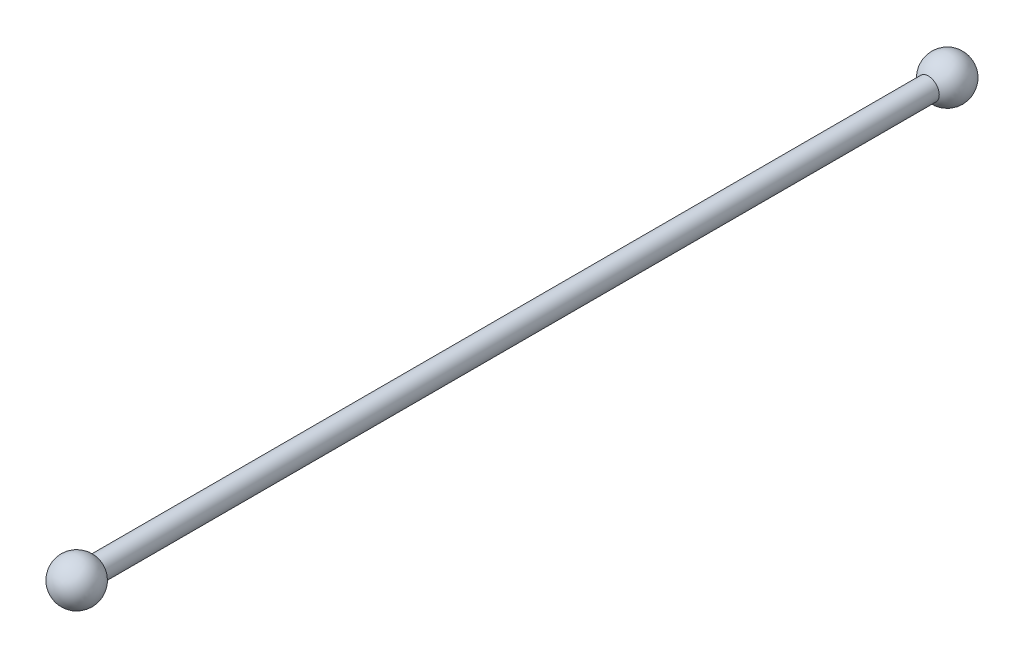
ISO-10303-21;
HEADER;
FILE_DESCRIPTION(('STEP AP214'),'2;1');
FILE_NAME('part.step','',(''),(''),'','','');
FILE_SCHEMA(('AUTOMOTIVE_DESIGN { 1 0 10303 214 1 1 1 1 }'));
ENDSEC;
DATA;
#1=APPLICATION_CONTEXT('core data for automotive mechanical design processes');
#2=APPLICATION_PROTOCOL_DEFINITION('international standard','automotive_design',2000,#1);
#3=PRODUCT_CONTEXT('',#1,'mechanical');
#4=PRODUCT('Part','Part','',(#3));
#5=PRODUCT_RELATED_PRODUCT_CATEGORY('part','',(#4));
#6=PRODUCT_DEFINITION_FORMATION('','',#4);
#7=PRODUCT_DEFINITION_CONTEXT('part definition',#1,'design');
#8=PRODUCT_DEFINITION('design','',#6,#7);
#9=PRODUCT_DEFINITION_SHAPE('','',#8);
#10=(LENGTH_UNIT() NAMED_UNIT(*) SI_UNIT(.MILLI.,.METRE.));
#11=(NAMED_UNIT(*) PLANE_ANGLE_UNIT() SI_UNIT($,.RADIAN.));
#12=(NAMED_UNIT(*) SI_UNIT($,.STERADIAN.) SOLID_ANGLE_UNIT());
#13=UNCERTAINTY_MEASURE_WITH_UNIT(LENGTH_MEASURE(1.E-05),#10,'distance_accuracy_value','');
#14=(GEOMETRIC_REPRESENTATION_CONTEXT(3) GLOBAL_UNCERTAINTY_ASSIGNED_CONTEXT((#13)) GLOBAL_UNIT_ASSIGNED_CONTEXT((#10,
#11,#12)) REPRESENTATION_CONTEXT('',''));
#15=CARTESIAN_POINT('',(0.,0.,0.));
#16=DIRECTION('',(0.,0.,1.));
#17=DIRECTION('',(1.,0.,0.));
#18=AXIS2_PLACEMENT_3D('',#15,#16,#17);
#19=CARTESIAN_POINT('',(0.,0.,1000.));
#20=DIRECTION('',(0.,0.,-1.));
#21=DIRECTION('',(-1.,0.,0.));
#22=AXIS2_PLACEMENT_3D('',#19,#20,#21);
#23=CYLINDRICAL_SURFACE('',#22,25.);
#24=CARTESIAN_POINT('',(0.,0.,956.698729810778));
#25=DIRECTION('',(0.,0.,1.));
#26=DIRECTION('',(1.,0.,0.));
#27=AXIS2_PLACEMENT_3D('',#24,#25,#26);
#28=CIRCLE('',#27,25.);
#29=CARTESIAN_POINT('',(25.,0.,956.698729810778));
#30=VERTEX_POINT('',#29);
#31=EDGE_CURVE('E40',#30,#30,#28,.T.);
#32=ORIENTED_EDGE('',*,*,#31,.F.);
#33=EDGE_LOOP('',(#32));
#34=FACE_BOUND('',#33,.T.);
#35=CARTESIAN_POINT('',(0.,0.,-956.698729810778));
#36=DIRECTION('',(0.,0.,-0.999999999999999));
#37=DIRECTION('',(-1.,0.,0.));
#38=AXIS2_PLACEMENT_3D('',#35,#36,#37);
#39=CIRCLE('',#38,25.);
#40=CARTESIAN_POINT('',(-25.,0.,-956.698729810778));
#41=VERTEX_POINT('',#40);
#42=EDGE_CURVE('E10',#41,#41,#39,.T.);
#43=ORIENTED_EDGE('',*,*,#42,.F.);
#44=EDGE_LOOP('',(#43));
#45=FACE_BOUND('',#44,.T.);
#46=ADVANCED_FACE('F34',(#34,#45),#23,.T.);
#47=CARTESIAN_POINT('',(0.,0.,1000.));
#48=DIRECTION('',(0.,0.,-1.));
#49=DIRECTION('',(1.,0.,0.));
#50=AXIS2_PLACEMENT_3D('',#47,#48,#49);
#51=SPHERICAL_SURFACE('',#50,50.);
#52=ORIENTED_EDGE('',*,*,#31,.T.);
#53=EDGE_LOOP('',(#52));
#54=FACE_BOUND('',#53,.T.);
#55=ADVANCED_FACE('F47',(#54),#51,.T.);
#56=CARTESIAN_POINT('',(0.,0.,-1000.));
#57=DIRECTION('',(0.,0.,1.));
#58=DIRECTION('',(1.,0.,0.));
#59=AXIS2_PLACEMENT_3D('',#56,#57,#58);
#60=SPHERICAL_SURFACE('',#59,50.);
#61=ORIENTED_EDGE('',*,*,#42,.T.);
#62=EDGE_LOOP('',(#61));
#63=FACE_BOUND('',#62,.T.);
#64=ADVANCED_FACE('F54',(#63),#60,.T.);
#65=CLOSED_SHELL('',(#46,#55,#64));
#66=MANIFOLD_SOLID_BREP('B2',#65);
#67=ADVANCED_BREP_SHAPE_REPRESENTATION('',(#18,#66),#14);
#68=SHAPE_DEFINITION_REPRESENTATION(#9,#67);
ENDSEC;
END-ISO-10303-21;
